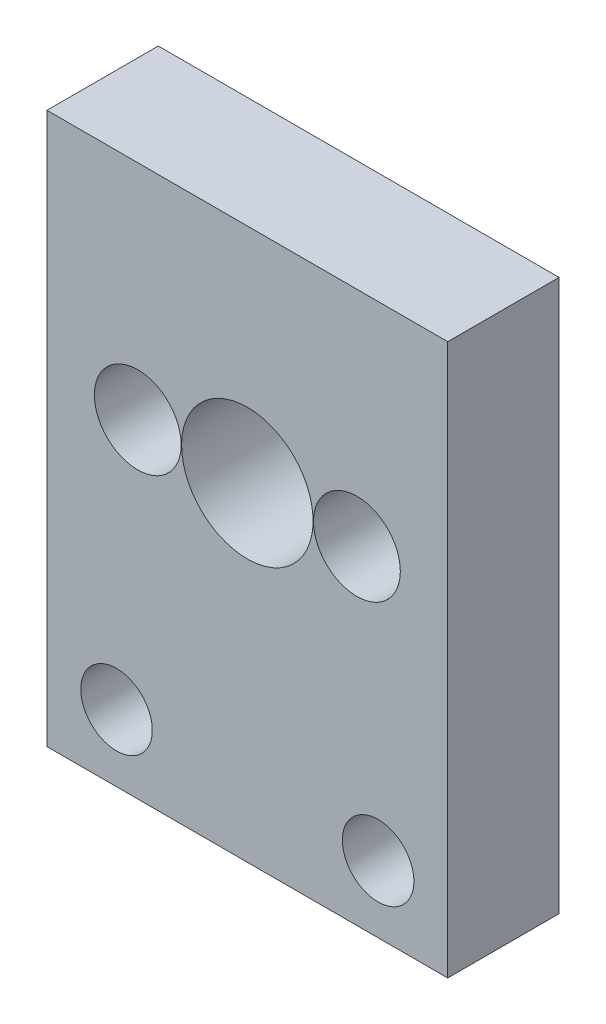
ISO-10303-21;
HEADER;
FILE_DESCRIPTION(('STEP AP214'),'2;1');
FILE_NAME('part.step','',(''),(''),'','','');
FILE_SCHEMA(('AUTOMOTIVE_DESIGN { 1 0 10303 214 1 1 1 1 }'));
ENDSEC;
DATA;
#1=APPLICATION_CONTEXT('core data for automotive mechanical design processes');
#2=APPLICATION_PROTOCOL_DEFINITION('international standard','automotive_design',2000,#1);
#3=PRODUCT_CONTEXT('',#1,'mechanical');
#4=PRODUCT('Part','Part','',(#3));
#5=PRODUCT_RELATED_PRODUCT_CATEGORY('part','',(#4));
#6=PRODUCT_DEFINITION_FORMATION('','',#4);
#7=PRODUCT_DEFINITION_CONTEXT('part definition',#1,'design');
#8=PRODUCT_DEFINITION('design','',#6,#7);
#9=PRODUCT_DEFINITION_SHAPE('','',#8);
#10=(LENGTH_UNIT() NAMED_UNIT(*) SI_UNIT(.MILLI.,.METRE.));
#11=(NAMED_UNIT(*) PLANE_ANGLE_UNIT() SI_UNIT($,.RADIAN.));
#12=(NAMED_UNIT(*) SI_UNIT($,.STERADIAN.) SOLID_ANGLE_UNIT());
#13=UNCERTAINTY_MEASURE_WITH_UNIT(LENGTH_MEASURE(1.E-05),#10,'distance_accuracy_value','');
#14=(GEOMETRIC_REPRESENTATION_CONTEXT(3) GLOBAL_UNCERTAINTY_ASSIGNED_CONTEXT((#13)) GLOBAL_UNIT_ASSIGNED_CONTEXT((#10,
#11,#12)) REPRESENTATION_CONTEXT('',''));
#15=CARTESIAN_POINT('',(0.,0.,0.));
#16=DIRECTION('',(0.,0.,1.));
#17=DIRECTION('',(1.,0.,0.));
#18=AXIS2_PLACEMENT_3D('',#15,#16,#17);
#19=CARTESIAN_POINT('',(-9.144,10.16,5.08));
#20=DIRECTION('',(1.,0.,0.));
#21=DIRECTION('',(0.,1.,0.));
#22=AXIS2_PLACEMENT_3D('',#19,#20,#21);
#23=PLANE('',#22);
#24=DIRECTION('',(0.,-1.,0.));
#25=VECTOR('',#24,1.);
#26=CARTESIAN_POINT('',(-9.144,10.16,0.));
#27=LINE('',#26,#25);
#28=CARTESIAN_POINT('',(-9.144,10.16,0.));
#29=VERTEX_POINT('',#28);
#30=CARTESIAN_POINT('',(-9.144,-14.986,0.));
#31=VERTEX_POINT('',#30);
#32=EDGE_CURVE('E97',#29,#31,#27,.T.);
#33=ORIENTED_EDGE('',*,*,#32,.T.);
#34=DIRECTION('',(0.,0.,-1.));
#35=VECTOR('',#34,1.);
#36=CARTESIAN_POINT('',(-9.144,-14.986,5.08));
#37=LINE('',#36,#35);
#38=CARTESIAN_POINT('',(-9.144,-14.986,5.08));
#39=VERTEX_POINT('',#38);
#40=EDGE_CURVE('E11',#39,#31,#37,.T.);
#41=ORIENTED_EDGE('',*,*,#40,.F.);
#42=DIRECTION('',(0.,-1.,0.));
#43=VECTOR('',#42,1.);
#44=CARTESIAN_POINT('',(-9.144,10.16,5.08));
#45=LINE('',#44,#43);
#46=CARTESIAN_POINT('',(-9.144,10.16,5.08));
#47=VERTEX_POINT('',#46);
#48=EDGE_CURVE('E85',#47,#39,#45,.T.);
#49=ORIENTED_EDGE('',*,*,#48,.F.);
#50=DIRECTION('',(0.,0.,-1.));
#51=VECTOR('',#50,1.);
#52=CARTESIAN_POINT('',(-9.144,10.16,5.08));
#53=LINE('',#52,#51);
#54=EDGE_CURVE('E93',#47,#29,#53,.T.);
#55=ORIENTED_EDGE('',*,*,#54,.T.);
#56=EDGE_LOOP('',(#33,#41,#49,#55));
#57=FACE_BOUND('',#56,.T.);
#58=ADVANCED_FACE('F34',(#57),#23,.F.);
#59=CARTESIAN_POINT('',(-9.144,-14.986,5.08));
#60=DIRECTION('',(0.,1.,0.));
#61=DIRECTION('',(0.,0.,1.));
#62=AXIS2_PLACEMENT_3D('',#59,#60,#61);
#63=PLANE('',#62);
#64=DIRECTION('',(1.,0.,0.));
#65=VECTOR('',#64,1.);
#66=CARTESIAN_POINT('',(-9.144,-14.986,0.));
#67=LINE('',#66,#65);
#68=CARTESIAN_POINT('',(9.144,-14.986,0.));
#69=VERTEX_POINT('',#68);
#70=EDGE_CURVE('E89',#31,#69,#67,.T.);
#71=ORIENTED_EDGE('',*,*,#70,.T.);
#72=DIRECTION('',(0.,0.,-1.));
#73=VECTOR('',#72,1.);
#74=CARTESIAN_POINT('',(9.144,-14.986,5.08));
#75=LINE('',#74,#73);
#76=CARTESIAN_POINT('',(9.144,-14.986,5.08));
#77=VERTEX_POINT('',#76);
#78=EDGE_CURVE('E42',#77,#69,#75,.T.);
#79=ORIENTED_EDGE('',*,*,#78,.F.);
#80=DIRECTION('',(1.,0.,0.));
#81=VECTOR('',#80,1.);
#82=CARTESIAN_POINT('',(-9.144,-14.986,5.08));
#83=LINE('',#82,#81);
#84=EDGE_CURVE('E80',#39,#77,#83,.T.);
#85=ORIENTED_EDGE('',*,*,#84,.F.);
#86=ORIENTED_EDGE('',*,*,#40,.T.);
#87=EDGE_LOOP('',(#71,#79,#85,#86));
#88=FACE_BOUND('',#87,.T.);
#89=ADVANCED_FACE('F88',(#88),#63,.F.);
#90=CARTESIAN_POINT('',(9.144,10.16,5.08));
#91=DIRECTION('',(-1.,0.,0.));
#92=DIRECTION('',(0.,-1.,0.));
#93=AXIS2_PLACEMENT_3D('',#90,#91,#92);
#94=PLANE('',#93);
#95=DIRECTION('',(0.,1.,0.));
#96=VECTOR('',#95,1.);
#97=CARTESIAN_POINT('',(9.144,10.16,0.));
#98=LINE('',#97,#96);
#99=CARTESIAN_POINT('',(9.144,10.16,0.));
#100=VERTEX_POINT('',#99);
#101=EDGE_CURVE('E67',#69,#100,#98,.T.);
#102=ORIENTED_EDGE('',*,*,#101,.T.);
#103=DIRECTION('',(0.,0.,-1.));
#104=VECTOR('',#103,1.);
#105=CARTESIAN_POINT('',(9.144,10.16,5.08));
#106=LINE('',#105,#104);
#107=CARTESIAN_POINT('',(9.144,10.16,5.08));
#108=VERTEX_POINT('',#107);
#109=EDGE_CURVE('E90',#108,#100,#106,.T.);
#110=ORIENTED_EDGE('',*,*,#109,.F.);
#111=DIRECTION('',(0.,1.,0.));
#112=VECTOR('',#111,1.);
#113=CARTESIAN_POINT('',(9.144,10.16,5.08));
#114=LINE('',#113,#112);
#115=EDGE_CURVE('E83',#77,#108,#114,.T.);
#116=ORIENTED_EDGE('',*,*,#115,.F.);
#117=ORIENTED_EDGE('',*,*,#78,.T.);
#118=EDGE_LOOP('',(#102,#110,#116,#117));
#119=FACE_BOUND('',#118,.T.);
#120=ADVANCED_FACE('F91',(#119),#94,.F.);
#121=CARTESIAN_POINT('',(-9.144,10.16,5.08));
#122=DIRECTION('',(0.,-1.,0.));
#123=DIRECTION('',(0.,0.,-1.));
#124=AXIS2_PLACEMENT_3D('',#121,#122,#123);
#125=PLANE('',#124);
#126=DIRECTION('',(-1.,0.,0.));
#127=VECTOR('',#126,1.);
#128=CARTESIAN_POINT('',(-9.144,10.16,0.));
#129=LINE('',#128,#127);
#130=EDGE_CURVE('E73',#100,#29,#129,.T.);
#131=ORIENTED_EDGE('',*,*,#130,.T.);
#132=ORIENTED_EDGE('',*,*,#54,.F.);
#133=DIRECTION('',(-1.,0.,0.));
#134=VECTOR('',#133,1.);
#135=CARTESIAN_POINT('',(-9.144,10.16,5.08));
#136=LINE('',#135,#134);
#137=EDGE_CURVE('E50',#108,#47,#136,.T.);
#138=ORIENTED_EDGE('',*,*,#137,.F.);
#139=ORIENTED_EDGE('',*,*,#109,.T.);
#140=EDGE_LOOP('',(#131,#132,#138,#139));
#141=FACE_BOUND('',#140,.T.);
#142=ADVANCED_FACE('F105',(#141),#125,.F.);
#143=CARTESIAN_POINT('',(-9.144,-14.986,5.08));
#144=DIRECTION('',(0.,0.,1.));
#145=DIRECTION('',(1.,0.,0.));
#146=AXIS2_PLACEMENT_3D('',#143,#144,#145);
#147=PLANE('',#146);
#148=CARTESIAN_POINT('',(5.969,-11.938,5.08));
#149=DIRECTION('',(0.,0.,-1.));
#150=DIRECTION('',(-1.,0.,0.));
#151=AXIS2_PLACEMENT_3D('',#148,#149,#150);
#152=CIRCLE('',#151,1.63195);
#153=CARTESIAN_POINT('',(4.33705,-11.938,5.08));
#154=VERTEX_POINT('',#153);
#155=EDGE_CURVE('E146',#154,#154,#152,.T.);
#156=ORIENTED_EDGE('',*,*,#155,.T.);
#157=EDGE_LOOP('',(#156));
#158=FACE_BOUND('',#157,.T.);
#159=CARTESIAN_POINT('',(-5.969,-11.938,5.08));
#160=DIRECTION('',(0.,0.,-1.));
#161=DIRECTION('',(-1.,0.,0.));
#162=AXIS2_PLACEMENT_3D('',#159,#160,#161);
#163=CIRCLE('',#162,1.63195);
#164=CARTESIAN_POINT('',(-7.60095,-11.938,5.08));
#165=VERTEX_POINT('',#164);
#166=EDGE_CURVE('E140',#165,#165,#163,.T.);
#167=ORIENTED_EDGE('',*,*,#166,.T.);
#168=EDGE_LOOP('',(#167));
#169=FACE_BOUND('',#168,.T.);
#170=CARTESIAN_POINT('',(5.,0.,5.08));
#171=DIRECTION('',(0.,0.,1.));
#172=DIRECTION('',(1.,0.,0.));
#173=AXIS2_PLACEMENT_3D('',#170,#171,#172);
#174=CIRCLE('',#173,1.9812);
#175=CARTESIAN_POINT('',(6.9812,0.,5.08));
#176=VERTEX_POINT('',#175);
#177=EDGE_CURVE('E128',#176,#176,#174,.T.);
#178=ORIENTED_EDGE('',*,*,#177,.F.);
#179=EDGE_LOOP('',(#178));
#180=FACE_BOUND('',#179,.T.);
#181=CARTESIAN_POINT('',(-5.,0.,5.08));
#182=DIRECTION('',(0.,0.,1.));
#183=DIRECTION('',(1.,0.,0.));
#184=AXIS2_PLACEMENT_3D('',#181,#182,#183);
#185=CIRCLE('',#184,1.9812);
#186=CARTESIAN_POINT('',(-3.0188,0.,5.08));
#187=VERTEX_POINT('',#186);
#188=EDGE_CURVE('E114',#187,#187,#185,.T.);
#189=ORIENTED_EDGE('',*,*,#188,.F.);
#190=EDGE_LOOP('',(#189));
#191=FACE_BOUND('',#190,.T.);
#192=CARTESIAN_POINT('',(0.,0.,5.08));
#193=DIRECTION('',(0.,0.,-1.));
#194=DIRECTION('',(-1.,0.,0.));
#195=AXIS2_PLACEMENT_3D('',#192,#193,#194);
#196=CIRCLE('',#195,3.);
#197=CARTESIAN_POINT('',(-3.,0.,5.08));
#198=VERTEX_POINT('',#197);
#199=EDGE_CURVE('E100',#198,#198,#196,.T.);
#200=ORIENTED_EDGE('',*,*,#199,.T.);
#201=EDGE_LOOP('',(#200));
#202=FACE_BOUND('',#201,.T.);
#203=ORIENTED_EDGE('',*,*,#48,.T.);
#204=ORIENTED_EDGE('',*,*,#84,.T.);
#205=ORIENTED_EDGE('',*,*,#115,.T.);
#206=ORIENTED_EDGE('',*,*,#137,.T.);
#207=EDGE_LOOP('',(#203,#204,#205,#206));
#208=FACE_BOUND('',#207,.T.);
#209=ADVANCED_FACE('F81',(#158,#169,#180,#191,#202,#208),#147,.T.);
#210=CARTESIAN_POINT('',(-9.144,-14.986,0.));
#211=DIRECTION('',(0.,0.,1.));
#212=DIRECTION('',(1.,0.,0.));
#213=AXIS2_PLACEMENT_3D('',#210,#211,#212);
#214=PLANE('',#213);
#215=CARTESIAN_POINT('',(5.969,-11.938,0.));
#216=DIRECTION('',(0.,0.,-1.));
#217=DIRECTION('',(-1.,0.,0.));
#218=AXIS2_PLACEMENT_3D('',#215,#216,#217);
#219=CIRCLE('',#218,1.63194999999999);
#220=CARTESIAN_POINT('',(4.33705000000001,-11.938,0.));
#221=VERTEX_POINT('',#220);
#222=EDGE_CURVE('E149',#221,#221,#219,.T.);
#223=ORIENTED_EDGE('',*,*,#222,.F.);
#224=EDGE_LOOP('',(#223));
#225=FACE_BOUND('',#224,.T.);
#226=CARTESIAN_POINT('',(-5.969,-11.938,0.));
#227=DIRECTION('',(0.,0.,-1.));
#228=DIRECTION('',(-1.,0.,0.));
#229=AXIS2_PLACEMENT_3D('',#226,#227,#228);
#230=CIRCLE('',#229,1.63194999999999);
#231=CARTESIAN_POINT('',(-7.60094999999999,-11.938,0.));
#232=VERTEX_POINT('',#231);
#233=EDGE_CURVE('E143',#232,#232,#230,.T.);
#234=ORIENTED_EDGE('',*,*,#233,.F.);
#235=EDGE_LOOP('',(#234));
#236=FACE_BOUND('',#235,.T.);
#237=CARTESIAN_POINT('',(5.,0.,0.));
#238=DIRECTION('',(0.,0.,1.));
#239=DIRECTION('',(1.,0.,0.));
#240=AXIS2_PLACEMENT_3D('',#237,#238,#239);
#241=CIRCLE('',#240,1.05);
#242=CARTESIAN_POINT('',(6.05,0.,0.));
#243=VERTEX_POINT('',#242);
#244=EDGE_CURVE('E137',#243,#243,#241,.T.);
#245=ORIENTED_EDGE('',*,*,#244,.T.);
#246=EDGE_LOOP('',(#245));
#247=FACE_BOUND('',#246,.T.);
#248=CARTESIAN_POINT('',(-5.,0.,0.));
#249=DIRECTION('',(0.,0.,1.));
#250=DIRECTION('',(1.,0.,0.));
#251=AXIS2_PLACEMENT_3D('',#248,#249,#250);
#252=CIRCLE('',#251,1.05);
#253=CARTESIAN_POINT('',(-3.95,0.,0.));
#254=VERTEX_POINT('',#253);
#255=EDGE_CURVE('E125',#254,#254,#252,.T.);
#256=ORIENTED_EDGE('',*,*,#255,.T.);
#257=EDGE_LOOP('',(#256));
#258=FACE_BOUND('',#257,.T.);
#259=CARTESIAN_POINT('',(0.,0.,0.));
#260=DIRECTION('',(0.,0.,-1.));
#261=DIRECTION('',(-1.,0.,0.));
#262=AXIS2_PLACEMENT_3D('',#259,#260,#261);
#263=CIRCLE('',#262,3.);
#264=CARTESIAN_POINT('',(-3.,0.,0.));
#265=VERTEX_POINT('',#264);
#266=EDGE_CURVE('E111',#265,#265,#263,.T.);
#267=ORIENTED_EDGE('',*,*,#266,.F.);
#268=EDGE_LOOP('',(#267));
#269=FACE_BOUND('',#268,.T.);
#270=ORIENTED_EDGE('',*,*,#32,.F.);
#271=ORIENTED_EDGE('',*,*,#130,.F.);
#272=ORIENTED_EDGE('',*,*,#101,.F.);
#273=ORIENTED_EDGE('',*,*,#70,.F.);
#274=EDGE_LOOP('',(#270,#271,#272,#273));
#275=FACE_BOUND('',#274,.T.);
#276=ADVANCED_FACE('F108',(#225,#236,#247,#258,#269,#275),#214,.F.);
#277=CARTESIAN_POINT('',(0.,0.,5.08));
#278=DIRECTION('',(0.,0.,-1.));
#279=DIRECTION('',(-1.,0.,0.));
#280=AXIS2_PLACEMENT_3D('',#277,#278,#279);
#281=CYLINDRICAL_SURFACE('',#280,3.);
#282=ORIENTED_EDGE('',*,*,#199,.F.);
#283=EDGE_LOOP('',(#282));
#284=FACE_BOUND('',#283,.T.);
#285=ORIENTED_EDGE('',*,*,#266,.T.);
#286=EDGE_LOOP('',(#285));
#287=FACE_BOUND('',#286,.T.);
#288=ADVANCED_FACE('F157',(#284,#287),#281,.F.);
#289=CARTESIAN_POINT('',(-5.,0.,5.08));
#290=DIRECTION('',(0.,0.,1.));
#291=DIRECTION('',(1.,0.,0.));
#292=AXIS2_PLACEMENT_3D('',#289,#290,#291);
#293=CYLINDRICAL_SURFACE('',#292,1.9812);
#294=CARTESIAN_POINT('',(-5.,0.,1.98));
#295=DIRECTION('',(0.,0.,1.));
#296=DIRECTION('',(1.,0.,0.));
#297=AXIS2_PLACEMENT_3D('',#294,#295,#296);
#298=CIRCLE('',#297,1.9812);
#299=CARTESIAN_POINT('',(-3.0188,0.,1.98));
#300=VERTEX_POINT('',#299);
#301=EDGE_CURVE('E119',#300,#300,#298,.T.);
#302=ORIENTED_EDGE('',*,*,#301,.F.);
#303=EDGE_LOOP('',(#302));
#304=FACE_BOUND('',#303,.T.);
#305=ORIENTED_EDGE('',*,*,#188,.T.);
#306=EDGE_LOOP('',(#305));
#307=FACE_BOUND('',#306,.T.);
#308=ADVANCED_FACE('F168',(#304,#307),#293,.F.);
#309=CARTESIAN_POINT('',(-3.95,0.,1.98));
#310=DIRECTION('',(0.,0.,-1.));
#311=DIRECTION('',(-1.,0.,0.));
#312=AXIS2_PLACEMENT_3D('',#309,#310,#311);
#313=PLANE('',#312);
#314=CARTESIAN_POINT('',(-5.,0.,1.98));
#315=DIRECTION('',(0.,0.,1.));
#316=DIRECTION('',(1.,0.,0.));
#317=AXIS2_PLACEMENT_3D('',#314,#315,#316);
#318=CIRCLE('',#317,1.05);
#319=CARTESIAN_POINT('',(-3.95,0.,1.98));
#320=VERTEX_POINT('',#319);
#321=EDGE_CURVE('E122',#320,#320,#318,.T.);
#322=ORIENTED_EDGE('',*,*,#321,.F.);
#323=EDGE_LOOP('',(#322));
#324=FACE_BOUND('',#323,.T.);
#325=ORIENTED_EDGE('',*,*,#301,.T.);
#326=EDGE_LOOP('',(#325));
#327=FACE_BOUND('',#326,.T.);
#328=ADVANCED_FACE('F174',(#324,#327),#313,.F.);
#329=CARTESIAN_POINT('',(-5.,0.,5.08));
#330=DIRECTION('',(0.,0.,1.));
#331=DIRECTION('',(1.,0.,0.));
#332=AXIS2_PLACEMENT_3D('',#329,#330,#331);
#333=CYLINDRICAL_SURFACE('',#332,1.05);
#334=ORIENTED_EDGE('',*,*,#255,.F.);
#335=EDGE_LOOP('',(#334));
#336=FACE_BOUND('',#335,.T.);
#337=ORIENTED_EDGE('',*,*,#321,.T.);
#338=EDGE_LOOP('',(#337));
#339=FACE_BOUND('',#338,.T.);
#340=ADVANCED_FACE('F206',(#336,#339),#333,.F.);
#341=CARTESIAN_POINT('',(5.,0.,5.08));
#342=DIRECTION('',(0.,0.,1.));
#343=DIRECTION('',(1.,0.,0.));
#344=AXIS2_PLACEMENT_3D('',#341,#342,#343);
#345=CYLINDRICAL_SURFACE('',#344,1.9812);
#346=CARTESIAN_POINT('',(5.,0.,1.98));
#347=DIRECTION('',(0.,0.,1.));
#348=DIRECTION('',(1.,0.,0.));
#349=AXIS2_PLACEMENT_3D('',#346,#347,#348);
#350=CIRCLE('',#349,1.9812);
#351=CARTESIAN_POINT('',(6.9812,0.,1.98));
#352=VERTEX_POINT('',#351);
#353=EDGE_CURVE('E131',#352,#352,#350,.T.);
#354=ORIENTED_EDGE('',*,*,#353,.F.);
#355=EDGE_LOOP('',(#354));
#356=FACE_BOUND('',#355,.T.);
#357=ORIENTED_EDGE('',*,*,#177,.T.);
#358=EDGE_LOOP('',(#357));
#359=FACE_BOUND('',#358,.T.);
#360=ADVANCED_FACE('F203',(#356,#359),#345,.F.);
#361=CARTESIAN_POINT('',(6.05,0.,1.98));
#362=DIRECTION('',(0.,0.,-1.));
#363=DIRECTION('',(-1.,0.,0.));
#364=AXIS2_PLACEMENT_3D('',#361,#362,#363);
#365=PLANE('',#364);
#366=CARTESIAN_POINT('',(5.,0.,1.98));
#367=DIRECTION('',(0.,0.,1.));
#368=DIRECTION('',(1.,0.,0.));
#369=AXIS2_PLACEMENT_3D('',#366,#367,#368);
#370=CIRCLE('',#369,1.05);
#371=CARTESIAN_POINT('',(6.05,0.,1.98));
#372=VERTEX_POINT('',#371);
#373=EDGE_CURVE('E134',#372,#372,#370,.T.);
#374=ORIENTED_EDGE('',*,*,#373,.F.);
#375=EDGE_LOOP('',(#374));
#376=FACE_BOUND('',#375,.T.);
#377=ORIENTED_EDGE('',*,*,#353,.T.);
#378=EDGE_LOOP('',(#377));
#379=FACE_BOUND('',#378,.T.);
#380=ADVANCED_FACE('F205',(#376,#379),#365,.F.);
#381=CARTESIAN_POINT('',(5.,0.,5.08));
#382=DIRECTION('',(0.,0.,1.));
#383=DIRECTION('',(1.,0.,0.));
#384=AXIS2_PLACEMENT_3D('',#381,#382,#383);
#385=CYLINDRICAL_SURFACE('',#384,1.05);
#386=ORIENTED_EDGE('',*,*,#244,.F.);
#387=EDGE_LOOP('',(#386));
#388=FACE_BOUND('',#387,.T.);
#389=ORIENTED_EDGE('',*,*,#373,.T.);
#390=EDGE_LOOP('',(#389));
#391=FACE_BOUND('',#390,.T.);
#392=ADVANCED_FACE('F213',(#388,#391),#385,.F.);
#393=CARTESIAN_POINT('',(-5.969,-11.938,0.));
#394=DIRECTION('',(0.,0.,-1.));
#395=DIRECTION('',(-1.,0.,0.));
#396=AXIS2_PLACEMENT_3D('',#393,#394,#395);
#397=CYLINDRICAL_SURFACE('',#396,1.63194999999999);
#398=ORIENTED_EDGE('',*,*,#166,.F.);
#399=EDGE_LOOP('',(#398));
#400=FACE_BOUND('',#399,.T.);
#401=ORIENTED_EDGE('',*,*,#233,.T.);
#402=EDGE_LOOP('',(#401));
#403=FACE_BOUND('',#402,.T.);
#404=ADVANCED_FACE('F253',(#400,#403),#397,.F.);
#405=CARTESIAN_POINT('',(5.969,-11.938,0.));
#406=DIRECTION('',(0.,0.,-1.));
#407=DIRECTION('',(-1.,0.,0.));
#408=AXIS2_PLACEMENT_3D('',#405,#406,#407);
#409=CYLINDRICAL_SURFACE('',#408,1.63194999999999);
#410=ORIENTED_EDGE('',*,*,#155,.F.);
#411=EDGE_LOOP('',(#410));
#412=FACE_BOUND('',#411,.T.);
#413=ORIENTED_EDGE('',*,*,#222,.T.);
#414=EDGE_LOOP('',(#413));
#415=FACE_BOUND('',#414,.T.);
#416=ADVANCED_FACE('F153',(#412,#415),#409,.F.);
#417=CLOSED_SHELL('',(#58,#89,#120,#142,#209,#276,#288,#308,#328,#340,#360,#380,#392,#404,#416));
#418=MANIFOLD_SOLID_BREP('B2',#417);
#419=ADVANCED_BREP_SHAPE_REPRESENTATION('',(#18,#418),#14);
#420=SHAPE_DEFINITION_REPRESENTATION(#9,#419);
ENDSEC;
END-ISO-10303-21;
